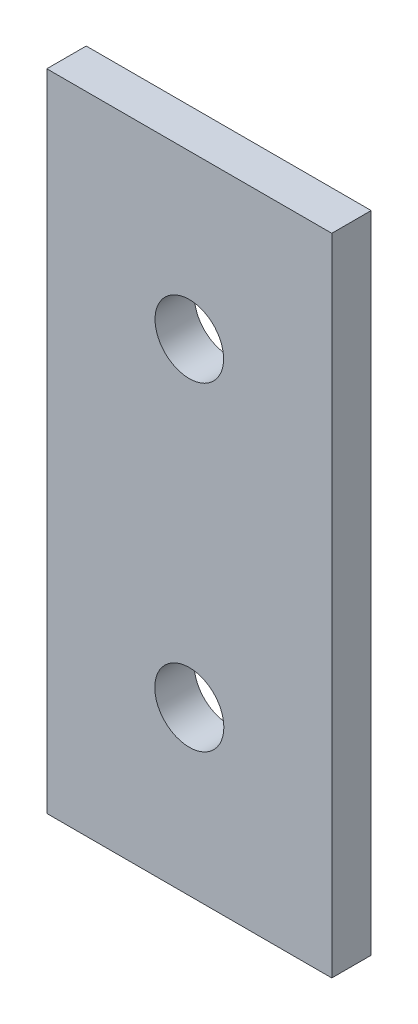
ISO-10303-21;
HEADER;
FILE_DESCRIPTION(('STEP AP214'),'2;1');
FILE_NAME('part.step','',(''),(''),'','','');
FILE_SCHEMA(('AUTOMOTIVE_DESIGN { 1 0 10303 214 1 1 1 1 }'));
ENDSEC;
DATA;
#1=APPLICATION_CONTEXT('core data for automotive mechanical design processes');
#2=APPLICATION_PROTOCOL_DEFINITION('international standard','automotive_design',2000,#1);
#3=PRODUCT_CONTEXT('',#1,'mechanical');
#4=PRODUCT('Part','Part','',(#3));
#5=PRODUCT_RELATED_PRODUCT_CATEGORY('part','',(#4));
#6=PRODUCT_DEFINITION_FORMATION('','',#4);
#7=PRODUCT_DEFINITION_CONTEXT('part definition',#1,'design');
#8=PRODUCT_DEFINITION('design','',#6,#7);
#9=PRODUCT_DEFINITION_SHAPE('','',#8);
#10=(LENGTH_UNIT() NAMED_UNIT(*) SI_UNIT(.MILLI.,.METRE.));
#11=(NAMED_UNIT(*) PLANE_ANGLE_UNIT() SI_UNIT($,.RADIAN.));
#12=(NAMED_UNIT(*) SI_UNIT($,.STERADIAN.) SOLID_ANGLE_UNIT());
#13=UNCERTAINTY_MEASURE_WITH_UNIT(LENGTH_MEASURE(1.E-05),#10,'distance_accuracy_value','');
#14=(GEOMETRIC_REPRESENTATION_CONTEXT(3) GLOBAL_UNCERTAINTY_ASSIGNED_CONTEXT((#13)) GLOBAL_UNIT_ASSIGNED_CONTEXT((#10,
#11,#12)) REPRESENTATION_CONTEXT('',''));
#15=CARTESIAN_POINT('',(0.,0.,0.));
#16=DIRECTION('',(0.,0.,1.));
#17=DIRECTION('',(1.,0.,0.));
#18=AXIS2_PLACEMENT_3D('',#15,#16,#17);
#19=CARTESIAN_POINT('',(16.891,38.227,4.67106));
#20=DIRECTION('',(-1.,0.,0.));
#21=DIRECTION('',(0.,-1.,0.));
#22=AXIS2_PLACEMENT_3D('',#19,#20,#21);
#23=PLANE('',#22);
#24=DIRECTION('',(0.,1.,0.));
#25=VECTOR('',#24,1.);
#26=CARTESIAN_POINT('',(16.891,38.227,0.));
#27=LINE('',#26,#25);
#28=CARTESIAN_POINT('',(16.891,-38.227,0.));
#29=VERTEX_POINT('',#28);
#30=CARTESIAN_POINT('',(16.891,38.227,0.));
#31=VERTEX_POINT('',#30);
#32=EDGE_CURVE('E95',#29,#31,#27,.T.);
#33=ORIENTED_EDGE('',*,*,#32,.T.);
#34=DIRECTION('',(0.,0.,-1.));
#35=VECTOR('',#34,1.);
#36=CARTESIAN_POINT('',(16.891,38.227,4.67106));
#37=LINE('',#36,#35);
#38=CARTESIAN_POINT('',(16.891,38.227,4.67106));
#39=VERTEX_POINT('',#38);
#40=EDGE_CURVE('E11',#39,#31,#37,.T.);
#41=ORIENTED_EDGE('',*,*,#40,.F.);
#42=DIRECTION('',(0.,1.,0.));
#43=VECTOR('',#42,1.);
#44=CARTESIAN_POINT('',(16.891,38.227,4.67106));
#45=LINE('',#44,#43);
#46=CARTESIAN_POINT('',(16.891,-38.227,4.67106));
#47=VERTEX_POINT('',#46);
#48=EDGE_CURVE('E83',#47,#39,#45,.T.);
#49=ORIENTED_EDGE('',*,*,#48,.F.);
#50=DIRECTION('',(0.,0.,-1.));
#51=VECTOR('',#50,1.);
#52=CARTESIAN_POINT('',(16.891,-38.227,4.67106));
#53=LINE('',#52,#51);
#54=EDGE_CURVE('E91',#47,#29,#53,.T.);
#55=ORIENTED_EDGE('',*,*,#54,.T.);
#56=EDGE_LOOP('',(#33,#41,#49,#55));
#57=FACE_BOUND('',#56,.T.);
#58=ADVANCED_FACE('F32',(#57),#23,.F.);
#59=CARTESIAN_POINT('',(-16.891,38.227,4.67106));
#60=DIRECTION('',(0.,-1.,0.));
#61=DIRECTION('',(0.,0.,-1.));
#62=AXIS2_PLACEMENT_3D('',#59,#60,#61);
#63=PLANE('',#62);
#64=DIRECTION('',(-1.,0.,0.));
#65=VECTOR('',#64,1.);
#66=CARTESIAN_POINT('',(-16.891,38.227,0.));
#67=LINE('',#66,#65);
#68=CARTESIAN_POINT('',(-16.891,38.227,0.));
#69=VERTEX_POINT('',#68);
#70=EDGE_CURVE('E87',#31,#69,#67,.T.);
#71=ORIENTED_EDGE('',*,*,#70,.T.);
#72=DIRECTION('',(0.,0.,-1.));
#73=VECTOR('',#72,1.);
#74=CARTESIAN_POINT('',(-16.891,38.227,4.67106));
#75=LINE('',#74,#73);
#76=CARTESIAN_POINT('',(-16.891,38.227,4.67106));
#77=VERTEX_POINT('',#76);
#78=EDGE_CURVE('E40',#77,#69,#75,.T.);
#79=ORIENTED_EDGE('',*,*,#78,.F.);
#80=DIRECTION('',(-1.,0.,0.));
#81=VECTOR('',#80,1.);
#82=CARTESIAN_POINT('',(-16.891,38.227,4.67106));
#83=LINE('',#82,#81);
#84=EDGE_CURVE('E78',#39,#77,#83,.T.);
#85=ORIENTED_EDGE('',*,*,#84,.F.);
#86=ORIENTED_EDGE('',*,*,#40,.T.);
#87=EDGE_LOOP('',(#71,#79,#85,#86));
#88=FACE_BOUND('',#87,.T.);
#89=ADVANCED_FACE('F86',(#88),#63,.F.);
#90=CARTESIAN_POINT('',(-16.891,38.227,4.67106));
#91=DIRECTION('',(1.,0.,0.));
#92=DIRECTION('',(0.,1.,0.));
#93=AXIS2_PLACEMENT_3D('',#90,#91,#92);
#94=PLANE('',#93);
#95=DIRECTION('',(0.,-1.,0.));
#96=VECTOR('',#95,1.);
#97=CARTESIAN_POINT('',(-16.891,38.227,0.));
#98=LINE('',#97,#96);
#99=CARTESIAN_POINT('',(-16.891,-38.227,0.));
#100=VERTEX_POINT('',#99);
#101=EDGE_CURVE('E65',#69,#100,#98,.T.);
#102=ORIENTED_EDGE('',*,*,#101,.T.);
#103=DIRECTION('',(0.,0.,-1.));
#104=VECTOR('',#103,1.);
#105=CARTESIAN_POINT('',(-16.891,-38.227,4.67106));
#106=LINE('',#105,#104);
#107=CARTESIAN_POINT('',(-16.891,-38.227,4.67106));
#108=VERTEX_POINT('',#107);
#109=EDGE_CURVE('E88',#108,#100,#106,.T.);
#110=ORIENTED_EDGE('',*,*,#109,.F.);
#111=DIRECTION('',(0.,-1.,0.));
#112=VECTOR('',#111,1.);
#113=CARTESIAN_POINT('',(-16.891,38.227,4.67106));
#114=LINE('',#113,#112);
#115=EDGE_CURVE('E81',#77,#108,#114,.T.);
#116=ORIENTED_EDGE('',*,*,#115,.F.);
#117=ORIENTED_EDGE('',*,*,#78,.T.);
#118=EDGE_LOOP('',(#102,#110,#116,#117));
#119=FACE_BOUND('',#118,.T.);
#120=ADVANCED_FACE('F89',(#119),#94,.F.);
#121=CARTESIAN_POINT('',(-16.891,-38.227,4.67106));
#122=DIRECTION('',(0.,1.,0.));
#123=DIRECTION('',(0.,0.,1.));
#124=AXIS2_PLACEMENT_3D('',#121,#122,#123);
#125=PLANE('',#124);
#126=DIRECTION('',(1.,0.,0.));
#127=VECTOR('',#126,1.);
#128=CARTESIAN_POINT('',(-16.891,-38.227,0.));
#129=LINE('',#128,#127);
#130=EDGE_CURVE('E71',#100,#29,#129,.T.);
#131=ORIENTED_EDGE('',*,*,#130,.T.);
#132=ORIENTED_EDGE('',*,*,#54,.F.);
#133=DIRECTION('',(1.,0.,0.));
#134=VECTOR('',#133,1.);
#135=CARTESIAN_POINT('',(-16.891,-38.227,4.67106));
#136=LINE('',#135,#134);
#137=EDGE_CURVE('E48',#108,#47,#136,.T.);
#138=ORIENTED_EDGE('',*,*,#137,.F.);
#139=ORIENTED_EDGE('',*,*,#109,.T.);
#140=EDGE_LOOP('',(#131,#132,#138,#139));
#141=FACE_BOUND('',#140,.T.);
#142=ADVANCED_FACE('F103',(#141),#125,.F.);
#143=CARTESIAN_POINT('',(0.,0.,4.67106));
#144=DIRECTION('',(0.,0.,1.));
#145=DIRECTION('',(1.,0.,0.));
#146=AXIS2_PLACEMENT_3D('',#143,#144,#145);
#147=PLANE('',#146);
#148=CARTESIAN_POINT('',(0.,18.923,4.67106));
#149=DIRECTION('',(0.,0.,1.));
#150=DIRECTION('',(1.,0.,0.));
#151=AXIS2_PLACEMENT_3D('',#148,#149,#150);
#152=CIRCLE('',#151,4.064);
#153=CARTESIAN_POINT('',(4.06400000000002,18.923,4.67106));
#154=VERTEX_POINT('',#153);
#155=EDGE_CURVE('E115',#154,#154,#152,.T.);
#156=ORIENTED_EDGE('',*,*,#155,.F.);
#157=EDGE_LOOP('',(#156));
#158=FACE_BOUND('',#157,.T.);
#159=CARTESIAN_POINT('',(0.,-18.8922749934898,4.67106));
#160=DIRECTION('',(0.,0.,1.));
#161=DIRECTION('',(1.,0.,0.));
#162=AXIS2_PLACEMENT_3D('',#159,#160,#161);
#163=CIRCLE('',#162,4.0947250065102);
#164=CARTESIAN_POINT('',(4.09472500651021,-18.8922749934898,4.67106));
#165=VERTEX_POINT('',#164);
#166=EDGE_CURVE('E109',#165,#165,#163,.T.);
#167=ORIENTED_EDGE('',*,*,#166,.F.);
#168=EDGE_LOOP('',(#167));
#169=FACE_BOUND('',#168,.T.);
#170=ORIENTED_EDGE('',*,*,#48,.T.);
#171=ORIENTED_EDGE('',*,*,#84,.T.);
#172=ORIENTED_EDGE('',*,*,#115,.T.);
#173=ORIENTED_EDGE('',*,*,#137,.T.);
#174=EDGE_LOOP('',(#170,#171,#172,#173));
#175=FACE_BOUND('',#174,.T.);
#176=ADVANCED_FACE('F79',(#158,#169,#175),#147,.T.);
#177=CARTESIAN_POINT('',(0.,0.,0.));
#178=DIRECTION('',(0.,0.,1.));
#179=DIRECTION('',(1.,0.,0.));
#180=AXIS2_PLACEMENT_3D('',#177,#178,#179);
#181=PLANE('',#180);
#182=CARTESIAN_POINT('',(0.,18.923,0.));
#183=DIRECTION('',(0.,0.,1.));
#184=DIRECTION('',(1.,0.,0.));
#185=AXIS2_PLACEMENT_3D('',#182,#183,#184);
#186=CIRCLE('',#185,4.064);
#187=CARTESIAN_POINT('',(4.06400000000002,18.923,0.));
#188=VERTEX_POINT('',#187);
#189=EDGE_CURVE('E98',#188,#188,#186,.T.);
#190=ORIENTED_EDGE('',*,*,#189,.T.);
#191=EDGE_LOOP('',(#190));
#192=FACE_BOUND('',#191,.T.);
#193=CARTESIAN_POINT('',(0.,-18.8922749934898,0.));
#194=DIRECTION('',(0.,0.,1.));
#195=DIRECTION('',(1.,0.,0.));
#196=AXIS2_PLACEMENT_3D('',#193,#194,#195);
#197=CIRCLE('',#196,4.0947250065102);
#198=CARTESIAN_POINT('',(4.09472500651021,-18.8922749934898,0.));
#199=VERTEX_POINT('',#198);
#200=EDGE_CURVE('E112',#199,#199,#197,.T.);
#201=ORIENTED_EDGE('',*,*,#200,.T.);
#202=EDGE_LOOP('',(#201));
#203=FACE_BOUND('',#202,.T.);
#204=ORIENTED_EDGE('',*,*,#32,.F.);
#205=ORIENTED_EDGE('',*,*,#130,.F.);
#206=ORIENTED_EDGE('',*,*,#101,.F.);
#207=ORIENTED_EDGE('',*,*,#70,.F.);
#208=EDGE_LOOP('',(#204,#205,#206,#207));
#209=FACE_BOUND('',#208,.T.);
#210=ADVANCED_FACE('F106',(#192,#203,#209),#181,.F.);
#211=CARTESIAN_POINT('',(0.,-18.8922749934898,0.));
#212=DIRECTION('',(0.,0.,1.));
#213=DIRECTION('',(1.,0.,0.));
#214=AXIS2_PLACEMENT_3D('',#211,#212,#213);
#215=CYLINDRICAL_SURFACE('',#214,4.0947250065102);
#216=ORIENTED_EDGE('',*,*,#200,.F.);
#217=EDGE_LOOP('',(#216));
#218=FACE_BOUND('',#217,.T.);
#219=ORIENTED_EDGE('',*,*,#166,.T.);
#220=EDGE_LOOP('',(#219));
#221=FACE_BOUND('',#220,.T.);
#222=ADVANCED_FACE('F126',(#218,#221),#215,.F.);
#223=CARTESIAN_POINT('',(0.,18.923,0.));
#224=DIRECTION('',(0.,0.,1.));
#225=DIRECTION('',(1.,0.,0.));
#226=AXIS2_PLACEMENT_3D('',#223,#224,#225);
#227=CYLINDRICAL_SURFACE('',#226,4.064);
#228=ORIENTED_EDGE('',*,*,#189,.F.);
#229=EDGE_LOOP('',(#228));
#230=FACE_BOUND('',#229,.T.);
#231=ORIENTED_EDGE('',*,*,#155,.T.);
#232=EDGE_LOOP('',(#231));
#233=FACE_BOUND('',#232,.T.);
#234=ADVANCED_FACE('F123',(#230,#233),#227,.F.);
#235=CLOSED_SHELL('',(#58,#89,#120,#142,#176,#210,#222,#234));
#236=MANIFOLD_SOLID_BREP('B2',#235);
#237=ADVANCED_BREP_SHAPE_REPRESENTATION('',(#18,#236),#14);
#238=SHAPE_DEFINITION_REPRESENTATION(#9,#237);
ENDSEC;
END-ISO-10303-21;
